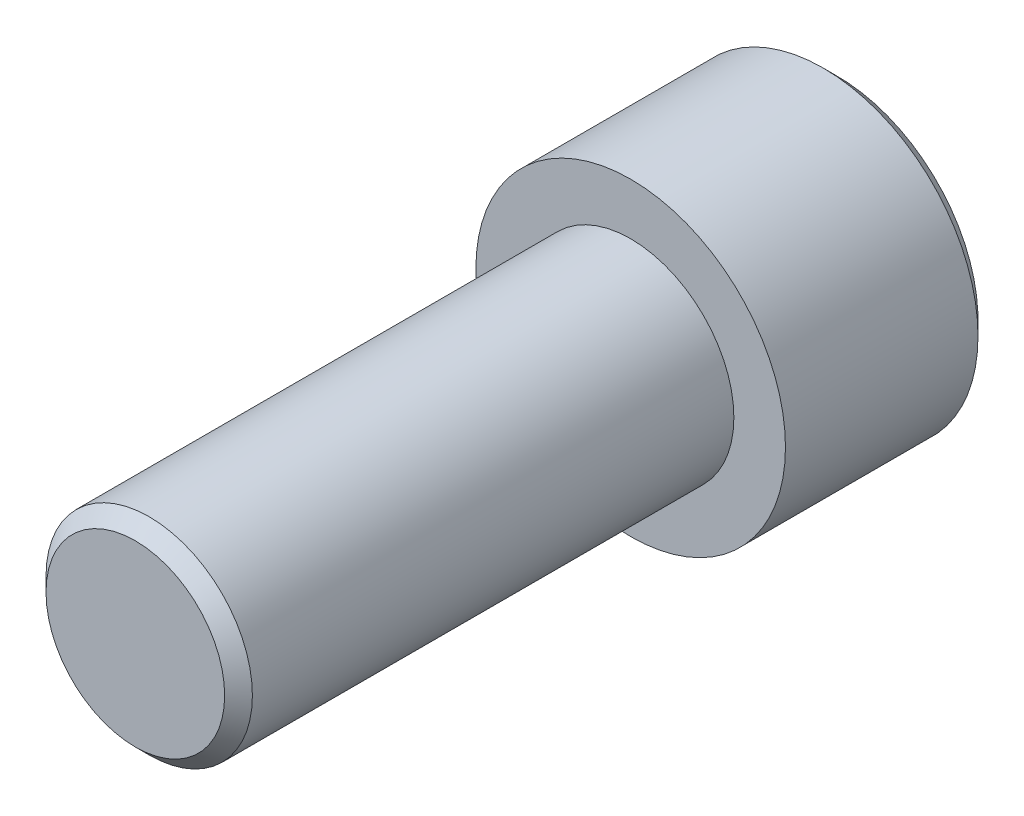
from build123d import *

# Parameters (mm, degrees)
CUT_EXTRUDE1_DEPTH = 6.35
CHAMFER2_SIZE      = 0.5334
CHAMFER3_SIZE      = 0.5334


with BuildPart() as part:
    # Sketch1 → Revolve1 (revolve)
    with BuildSketch(Plane(origin=(0, 0, 0), x_dir=(1, 0, 0), z_dir=(0, 1, 0))):
        Polygon((0, -19.05), (3.96875, -19.05), (3.96875, 0), (5.953125, 0), (5.953125, 7.9375), (0, 7.9375), (0, 0), align=None)
    revolve(axis=Axis((0, 0, 19.05), (0, 0, -1)))

    # Sketch2 → Cut-Extrude1 (cut)
    with BuildSketch(Plane(origin=(0, 0, -7.9375), x_dir=(-1, 0, 0), z_dir=(0, 0, -1))):
        Polygon((-3.18253485, -1.819973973), (-0.01512373, -3.666143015), (3.16741112, -1.846169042), (3.18253485, 1.819973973), (0.01512373, 3.666143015), (-3.16741112, 1.846169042), align=None)
    extrude(amount=-CUT_EXTRUDE1_DEPTH, mode=Mode.SUBTRACT)

    # Chamfer2
    chamfer2_edges = [part.edges().sort_by_distance(p)[0] for p in [
        (-5.953125, 0, -7.9375),
    ]]
    chamfer(chamfer2_edges, length=CHAMFER2_SIZE)

    # Chamfer3
    chamfer3_edges = [part.edges().sort_by_distance(p)[0] for p in [
        (-3.96875, 0, 19.05),
    ]]
    chamfer(chamfer3_edges, length=CHAMFER3_SIZE)


solid = part.part
